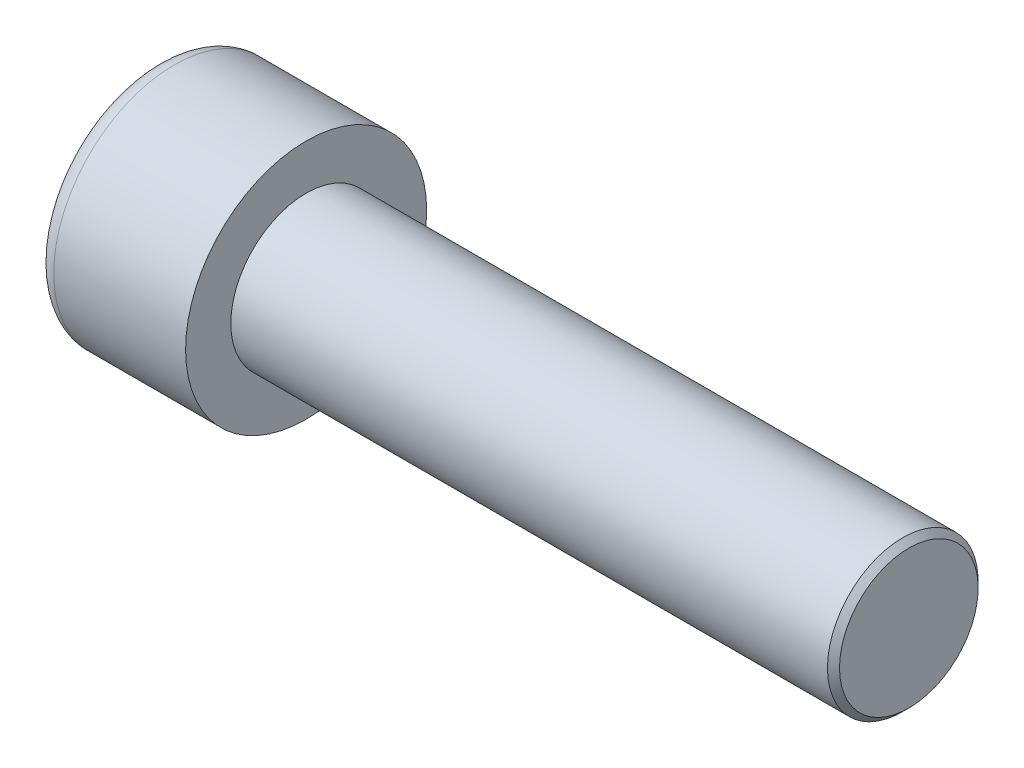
ISO-10303-21;
HEADER;
FILE_DESCRIPTION(('STEP AP214'),'2;1');
FILE_NAME('part.step','',(''),(''),'','','');
FILE_SCHEMA(('AUTOMOTIVE_DESIGN { 1 0 10303 214 1 1 1 1 }'));
ENDSEC;
DATA;
#1=APPLICATION_CONTEXT('core data for automotive mechanical design processes');
#2=APPLICATION_PROTOCOL_DEFINITION('international standard','automotive_design',2000,#1);
#3=PRODUCT_CONTEXT('',#1,'mechanical');
#4=PRODUCT('Part','Part','',(#3));
#5=PRODUCT_RELATED_PRODUCT_CATEGORY('part','',(#4));
#6=PRODUCT_DEFINITION_FORMATION('','',#4);
#7=PRODUCT_DEFINITION_CONTEXT('part definition',#1,'design');
#8=PRODUCT_DEFINITION('design','',#6,#7);
#9=PRODUCT_DEFINITION_SHAPE('','',#8);
#10=(LENGTH_UNIT() NAMED_UNIT(*) SI_UNIT(.MILLI.,.METRE.));
#11=(NAMED_UNIT(*) PLANE_ANGLE_UNIT() SI_UNIT($,.RADIAN.));
#12=(NAMED_UNIT(*) SI_UNIT($,.STERADIAN.) SOLID_ANGLE_UNIT());
#13=UNCERTAINTY_MEASURE_WITH_UNIT(LENGTH_MEASURE(1.E-05),#10,'distance_accuracy_value','');
#14=(GEOMETRIC_REPRESENTATION_CONTEXT(3) GLOBAL_UNCERTAINTY_ASSIGNED_CONTEXT((#13)) GLOBAL_UNIT_ASSIGNED_CONTEXT((#10,
#11,#12)) REPRESENTATION_CONTEXT('',''));
#15=CARTESIAN_POINT('',(0.,0.,0.));
#16=DIRECTION('',(0.,0.,1.));
#17=DIRECTION('',(1.,0.,0.));
#18=AXIS2_PLACEMENT_3D('',#15,#16,#17);
#19=CARTESIAN_POINT('',(5.0000000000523,0.,0.));
#20=DIRECTION('',(-1.,0.,0.));
#21=DIRECTION('',(0.,0.,1.));
#22=AXIS2_PLACEMENT_3D('',#19,#20,#21);
#23=CONICAL_SURFACE('',#22,3.99999999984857,1.0471975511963);
#24=CARTESIAN_POINT('',(7.30940107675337,0.,1.4210854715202E-10));
#25=VERTEX_POINT('',#24);
#26=VERTEX_LOOP('',#25);
#27=FACE_BOUND('',#26,.T.);
#28=CARTESIAN_POINT('',(5.00000000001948,0.,0.));
#29=DIRECTION('',(-1.,0.,0.));
#30=DIRECTION('',(0.,0.,1.));
#31=AXIS2_PLACEMENT_3D('',#28,#29,#30);
#32=CIRCLE('',#31,3.99999999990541);
#33=CARTESIAN_POINT('',(5.00000000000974,-1.99999999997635,3.4641016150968));
#34=VERTEX_POINT('',#33);
#35=CARTESIAN_POINT('',(5.00000000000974,1.99999999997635,3.4641016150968));
#36=VERTEX_POINT('',#35);
#37=EDGE_CURVE('E88',#34,#36,#32,.T.);
#38=ORIENTED_EDGE('',*,*,#37,.T.);
#39=CARTESIAN_POINT('',(5.00000000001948,0.,0.));
#40=DIRECTION('',(-1.,0.,0.));
#41=DIRECTION('',(0.,0.,1.));
#42=AXIS2_PLACEMENT_3D('',#39,#40,#41);
#43=CIRCLE('',#42,3.99999999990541);
#44=CARTESIAN_POINT('',(5.00000000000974,3.99999999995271,0.));
#45=VERTEX_POINT('',#44);
#46=EDGE_CURVE('E103',#36,#45,#43,.T.);
#47=ORIENTED_EDGE('',*,*,#46,.T.);
#48=CARTESIAN_POINT('',(5.00000000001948,0.,0.));
#49=DIRECTION('',(-1.,0.,0.));
#50=DIRECTION('',(0.,0.,1.));
#51=AXIS2_PLACEMENT_3D('',#48,#49,#50);
#52=CIRCLE('',#51,3.99999999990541);
#53=CARTESIAN_POINT('',(5.00000000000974,1.99999999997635,-3.4641016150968));
#54=VERTEX_POINT('',#53);
#55=EDGE_CURVE('E147',#45,#54,#52,.T.);
#56=ORIENTED_EDGE('',*,*,#55,.T.);
#57=CARTESIAN_POINT('',(5.00000000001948,0.,0.));
#58=DIRECTION('',(-1.,0.,0.));
#59=DIRECTION('',(0.,0.,1.));
#60=AXIS2_PLACEMENT_3D('',#57,#58,#59);
#61=CIRCLE('',#60,3.99999999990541);
#62=CARTESIAN_POINT('',(5.00000000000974,-1.99999999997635,-3.4641016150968));
#63=VERTEX_POINT('',#62);
#64=EDGE_CURVE('E135',#54,#63,#61,.T.);
#65=ORIENTED_EDGE('',*,*,#64,.T.);
#66=CARTESIAN_POINT('',(5.00000000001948,0.,0.));
#67=DIRECTION('',(-1.,0.,0.));
#68=DIRECTION('',(0.,0.,1.));
#69=AXIS2_PLACEMENT_3D('',#66,#67,#68);
#70=CIRCLE('',#69,3.99999999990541);
#71=CARTESIAN_POINT('',(5.00000000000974,-3.99999999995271,0.));
#72=VERTEX_POINT('',#71);
#73=EDGE_CURVE('E84',#63,#72,#70,.T.);
#74=ORIENTED_EDGE('',*,*,#73,.T.);
#75=CARTESIAN_POINT('',(5.00000000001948,0.,0.));
#76=DIRECTION('',(-1.,0.,0.));
#77=DIRECTION('',(0.,0.,1.));
#78=AXIS2_PLACEMENT_3D('',#75,#76,#77);
#79=CIRCLE('',#78,3.99999999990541);
#80=EDGE_CURVE('E86',#72,#34,#79,.T.);
#81=ORIENTED_EDGE('',*,*,#80,.T.);
#82=EDGE_LOOP('',(#38,#47,#56,#65,#74,#81));
#83=FACE_BOUND('',#82,.T.);
#84=ADVANCED_FACE('F17',(#27,#83),#23,.F.);
#85=CARTESIAN_POINT('',(5.,0.,-4.61880215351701));
#86=DIRECTION('',(1.,0.,0.));
#87=DIRECTION('',(0.,0.,-1.));
#88=AXIS2_PLACEMENT_3D('',#85,#86,#87);
#89=PLANE('',#88);
#90=DIRECTION('',(0.,0.,1.));
#91=VECTOR('',#90,1.);
#92=CARTESIAN_POINT('',(5.,-4.,2.3094010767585));
#93=LINE('',#92,#91);
#94=CARTESIAN_POINT('',(5.,-4.,2.3094010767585));
#95=VERTEX_POINT('',#94);
#96=EDGE_CURVE('E109',#95,#72,#93,.F.);
#97=ORIENTED_EDGE('',*,*,#96,.F.);
#98=DIRECTION('',(0.,0.866025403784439,0.5));
#99=VECTOR('',#98,1.);
#100=CARTESIAN_POINT('',(5.,0.,4.61880215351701));
#101=LINE('',#100,#99);
#102=EDGE_CURVE('E106',#34,#95,#101,.F.);
#103=ORIENTED_EDGE('',*,*,#102,.F.);
#104=ORIENTED_EDGE('',*,*,#80,.F.);
#105=EDGE_LOOP('',(#97,#103,#104));
#106=FACE_BOUND('',#105,.T.);
#107=ADVANCED_FACE('F107',(#106),#89,.F.);
#108=CARTESIAN_POINT('',(5.,0.,-4.61880215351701));
#109=DIRECTION('',(1.,0.,0.));
#110=DIRECTION('',(0.,0.,-1.));
#111=AXIS2_PLACEMENT_3D('',#108,#109,#110);
#112=PLANE('',#111);
#113=DIRECTION('',(0.,0.866025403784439,0.5));
#114=VECTOR('',#113,1.);
#115=CARTESIAN_POINT('',(5.,0.,4.61880215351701));
#116=LINE('',#115,#114);
#117=CARTESIAN_POINT('',(5.,0.,4.61880215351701));
#118=VERTEX_POINT('',#117);
#119=EDGE_CURVE('E98',#118,#34,#116,.F.);
#120=ORIENTED_EDGE('',*,*,#119,.F.);
#121=DIRECTION('',(0.,0.866025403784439,-0.5));
#122=VECTOR('',#121,1.);
#123=CARTESIAN_POINT('',(5.,4.,2.3094010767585));
#124=LINE('',#123,#122);
#125=EDGE_CURVE('E101',#36,#118,#124,.F.);
#126=ORIENTED_EDGE('',*,*,#125,.F.);
#127=ORIENTED_EDGE('',*,*,#37,.F.);
#128=EDGE_LOOP('',(#120,#126,#127));
#129=FACE_BOUND('',#128,.T.);
#130=ADVANCED_FACE('F96',(#129),#112,.F.);
#131=CARTESIAN_POINT('',(5.,0.,-4.61880215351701));
#132=DIRECTION('',(1.,0.,0.));
#133=DIRECTION('',(0.,0.,-1.));
#134=AXIS2_PLACEMENT_3D('',#131,#132,#133);
#135=PLANE('',#134);
#136=DIRECTION('',(0.,0.866025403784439,-0.5));
#137=VECTOR('',#136,1.);
#138=CARTESIAN_POINT('',(5.,4.,2.3094010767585));
#139=LINE('',#138,#137);
#140=CARTESIAN_POINT('',(5.,4.,2.3094010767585));
#141=VERTEX_POINT('',#140);
#142=EDGE_CURVE('E131',#141,#36,#139,.F.);
#143=ORIENTED_EDGE('',*,*,#142,.F.);
#144=DIRECTION('',(0.,0.,-1.));
#145=VECTOR('',#144,1.);
#146=CARTESIAN_POINT('',(5.,4.,-2.3094010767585));
#147=LINE('',#146,#145);
#148=EDGE_CURVE('E192',#45,#141,#147,.F.);
#149=ORIENTED_EDGE('',*,*,#148,.F.);
#150=ORIENTED_EDGE('',*,*,#46,.F.);
#151=EDGE_LOOP('',(#143,#149,#150));
#152=FACE_BOUND('',#151,.T.);
#153=ADVANCED_FACE('F401',(#152),#135,.F.);
#154=CARTESIAN_POINT('',(5.,0.,-4.61880215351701));
#155=DIRECTION('',(1.,0.,0.));
#156=DIRECTION('',(0.,0.,-1.));
#157=AXIS2_PLACEMENT_3D('',#154,#155,#156);
#158=PLANE('',#157);
#159=DIRECTION('',(0.,0.,-1.));
#160=VECTOR('',#159,1.);
#161=CARTESIAN_POINT('',(5.,4.,-2.3094010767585));
#162=LINE('',#161,#160);
#163=CARTESIAN_POINT('',(5.,4.,-2.3094010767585));
#164=VERTEX_POINT('',#163);
#165=EDGE_CURVE('E189',#164,#45,#162,.F.);
#166=ORIENTED_EDGE('',*,*,#165,.F.);
#167=DIRECTION('',(0.,-0.866025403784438,-0.5));
#168=VECTOR('',#167,1.);
#169=CARTESIAN_POINT('',(5.,0.,-4.61880215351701));
#170=LINE('',#169,#168);
#171=EDGE_CURVE('E177',#54,#164,#170,.F.);
#172=ORIENTED_EDGE('',*,*,#171,.F.);
#173=ORIENTED_EDGE('',*,*,#55,.F.);
#174=EDGE_LOOP('',(#166,#172,#173));
#175=FACE_BOUND('',#174,.T.);
#176=ADVANCED_FACE('F391',(#175),#158,.F.);
#177=CARTESIAN_POINT('',(5.,0.,-4.61880215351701));
#178=DIRECTION('',(1.,0.,0.));
#179=DIRECTION('',(0.,0.,-1.));
#180=AXIS2_PLACEMENT_3D('',#177,#178,#179);
#181=PLANE('',#180);
#182=DIRECTION('',(0.,-0.866025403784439,0.5));
#183=VECTOR('',#182,1.);
#184=CARTESIAN_POINT('',(5.,-4.,-2.3094010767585));
#185=LINE('',#184,#183);
#186=CARTESIAN_POINT('',(5.,-4.,-2.3094010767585));
#187=VERTEX_POINT('',#186);
#188=EDGE_CURVE('E231',#187,#63,#185,.F.);
#189=ORIENTED_EDGE('',*,*,#188,.F.);
#190=DIRECTION('',(0.,0.,1.));
#191=VECTOR('',#190,1.);
#192=CARTESIAN_POINT('',(5.,-4.,2.3094010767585));
#193=LINE('',#192,#191);
#194=EDGE_CURVE('E119',#72,#187,#193,.F.);
#195=ORIENTED_EDGE('',*,*,#194,.F.);
#196=ORIENTED_EDGE('',*,*,#73,.F.);
#197=EDGE_LOOP('',(#189,#195,#196));
#198=FACE_BOUND('',#197,.T.);
#199=ADVANCED_FACE('F381',(#198),#181,.F.);
#200=CARTESIAN_POINT('',(5.,0.,-4.61880215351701));
#201=DIRECTION('',(1.,0.,0.));
#202=DIRECTION('',(0.,0.,-1.));
#203=AXIS2_PLACEMENT_3D('',#200,#201,#202);
#204=PLANE('',#203);
#205=DIRECTION('',(0.,-0.866025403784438,-0.5));
#206=VECTOR('',#205,1.);
#207=CARTESIAN_POINT('',(5.,0.,-4.61880215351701));
#208=LINE('',#207,#206);
#209=CARTESIAN_POINT('',(5.,0.,-4.61880215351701));
#210=VERTEX_POINT('',#209);
#211=EDGE_CURVE('E181',#210,#54,#208,.F.);
#212=ORIENTED_EDGE('',*,*,#211,.F.);
#213=DIRECTION('',(0.,-0.866025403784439,0.5));
#214=VECTOR('',#213,1.);
#215=CARTESIAN_POINT('',(5.,-4.,-2.3094010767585));
#216=LINE('',#215,#214);
#217=EDGE_CURVE('E449',#63,#210,#216,.F.);
#218=ORIENTED_EDGE('',*,*,#217,.F.);
#219=ORIENTED_EDGE('',*,*,#64,.F.);
#220=EDGE_LOOP('',(#212,#218,#219));
#221=FACE_BOUND('',#220,.T.);
#222=ADVANCED_FACE('F371',(#221),#204,.F.);
#223=CARTESIAN_POINT('',(5.,-4.,2.3094010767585));
#224=DIRECTION('',(0.,1.,0.));
#225=DIRECTION('',(0.,0.,1.));
#226=AXIS2_PLACEMENT_3D('',#223,#224,#225);
#227=PLANE('',#226);
#228=ORIENTED_EDGE('',*,*,#194,.T.);
#229=DIRECTION('',(1.,0.,0.));
#230=VECTOR('',#229,1.);
#231=CARTESIAN_POINT('',(5.,-4.,-2.3094010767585));
#232=LINE('',#231,#230);
#233=CARTESIAN_POINT('',(0.,-4.,-2.3094010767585));
#234=VERTEX_POINT('',#233);
#235=EDGE_CURVE('E186',#234,#187,#232,.T.);
#236=ORIENTED_EDGE('',*,*,#235,.F.);
#237=DIRECTION('',(0.,0.,-1.));
#238=VECTOR('',#237,1.);
#239=CARTESIAN_POINT('',(0.,-4.,0.));
#240=LINE('',#239,#238);
#241=CARTESIAN_POINT('',(0.,-4.,2.3094010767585));
#242=VERTEX_POINT('',#241);
#243=EDGE_CURVE('E170',#234,#242,#240,.F.);
#244=ORIENTED_EDGE('',*,*,#243,.T.);
#245=DIRECTION('',(1.,0.,0.));
#246=VECTOR('',#245,1.);
#247=CARTESIAN_POINT('',(5.,-4.,2.3094010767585));
#248=LINE('',#247,#246);
#249=EDGE_CURVE('E113',#95,#242,#248,.F.);
#250=ORIENTED_EDGE('',*,*,#249,.F.);
#251=ORIENTED_EDGE('',*,*,#96,.T.);
#252=EDGE_LOOP('',(#228,#236,#244,#250,#251));
#253=FACE_BOUND('',#252,.T.);
#254=ADVANCED_FACE('F362',(#253),#227,.T.);
#255=CARTESIAN_POINT('',(5.,0.,4.61880215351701));
#256=DIRECTION('',(0.,0.5,-0.866025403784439));
#257=DIRECTION('',(0.,0.866025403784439,0.5));
#258=AXIS2_PLACEMENT_3D('',#255,#256,#257);
#259=PLANE('',#258);
#260=ORIENTED_EDGE('',*,*,#102,.T.);
#261=ORIENTED_EDGE('',*,*,#249,.T.);
#262=DIRECTION('',(0.,0.866025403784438,0.5));
#263=VECTOR('',#262,1.);
#264=CARTESIAN_POINT('',(0.,-4.,2.3094010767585));
#265=LINE('',#264,#263);
#266=CARTESIAN_POINT('',(0.,0.,4.61880215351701));
#267=VERTEX_POINT('',#266);
#268=EDGE_CURVE('E173',#242,#267,#265,.T.);
#269=ORIENTED_EDGE('',*,*,#268,.T.);
#270=DIRECTION('',(1.,0.,0.));
#271=VECTOR('',#270,1.);
#272=CARTESIAN_POINT('',(5.,0.,4.61880215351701));
#273=LINE('',#272,#271);
#274=EDGE_CURVE('E118',#118,#267,#273,.F.);
#275=ORIENTED_EDGE('',*,*,#274,.F.);
#276=ORIENTED_EDGE('',*,*,#119,.T.);
#277=EDGE_LOOP('',(#260,#261,#269,#275,#276));
#278=FACE_BOUND('',#277,.T.);
#279=ADVANCED_FACE('F115',(#278),#259,.T.);
#280=CARTESIAN_POINT('',(5.,4.,2.3094010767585));
#281=DIRECTION('',(0.,-0.5,-0.866025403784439));
#282=DIRECTION('',(0.,0.866025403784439,-0.5));
#283=AXIS2_PLACEMENT_3D('',#280,#281,#282);
#284=PLANE('',#283);
#285=ORIENTED_EDGE('',*,*,#125,.T.);
#286=ORIENTED_EDGE('',*,*,#274,.T.);
#287=DIRECTION('',(0.,0.866025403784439,-0.5));
#288=VECTOR('',#287,1.);
#289=CARTESIAN_POINT('',(0.,0.,4.61880215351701));
#290=LINE('',#289,#288);
#291=CARTESIAN_POINT('',(0.,4.,2.3094010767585));
#292=VERTEX_POINT('',#291);
#293=EDGE_CURVE('E216',#267,#292,#290,.T.);
#294=ORIENTED_EDGE('',*,*,#293,.T.);
#295=DIRECTION('',(1.,0.,0.));
#296=VECTOR('',#295,1.);
#297=CARTESIAN_POINT('',(5.,4.,2.3094010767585));
#298=LINE('',#297,#296);
#299=EDGE_CURVE('E197',#141,#292,#298,.F.);
#300=ORIENTED_EDGE('',*,*,#299,.F.);
#301=ORIENTED_EDGE('',*,*,#142,.T.);
#302=EDGE_LOOP('',(#285,#286,#294,#300,#301));
#303=FACE_BOUND('',#302,.T.);
#304=ADVANCED_FACE('F213',(#303),#284,.T.);
#305=CARTESIAN_POINT('',(5.,4.,-2.3094010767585));
#306=DIRECTION('',(0.,-1.,0.));
#307=DIRECTION('',(0.,0.,-1.));
#308=AXIS2_PLACEMENT_3D('',#305,#306,#307);
#309=PLANE('',#308);
#310=ORIENTED_EDGE('',*,*,#148,.T.);
#311=ORIENTED_EDGE('',*,*,#299,.T.);
#312=DIRECTION('',(0.,0.,-1.));
#313=VECTOR('',#312,1.);
#314=CARTESIAN_POINT('',(0.,4.,0.));
#315=LINE('',#314,#313);
#316=CARTESIAN_POINT('',(0.,4.,-2.3094010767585));
#317=VERTEX_POINT('',#316);
#318=EDGE_CURVE('E163',#292,#317,#315,.T.);
#319=ORIENTED_EDGE('',*,*,#318,.T.);
#320=DIRECTION('',(1.,0.,0.));
#321=VECTOR('',#320,1.);
#322=CARTESIAN_POINT('',(5.,4.,-2.3094010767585));
#323=LINE('',#322,#321);
#324=EDGE_CURVE('E180',#164,#317,#323,.F.);
#325=ORIENTED_EDGE('',*,*,#324,.F.);
#326=ORIENTED_EDGE('',*,*,#165,.T.);
#327=EDGE_LOOP('',(#310,#311,#319,#325,#326));
#328=FACE_BOUND('',#327,.T.);
#329=ADVANCED_FACE('F335',(#328),#309,.T.);
#330=CARTESIAN_POINT('',(5.,0.,-4.61880215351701));
#331=DIRECTION('',(0.,-0.5,0.866025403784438));
#332=DIRECTION('',(0.,-0.866025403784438,-0.5));
#333=AXIS2_PLACEMENT_3D('',#330,#331,#332);
#334=PLANE('',#333);
#335=ORIENTED_EDGE('',*,*,#171,.T.);
#336=ORIENTED_EDGE('',*,*,#324,.T.);
#337=DIRECTION('',(0.,-0.866025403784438,-0.5));
#338=VECTOR('',#337,1.);
#339=CARTESIAN_POINT('',(0.,4.,-2.3094010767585));
#340=LINE('',#339,#338);
#341=CARTESIAN_POINT('',(0.,0.,-4.61880215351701));
#342=VERTEX_POINT('',#341);
#343=EDGE_CURVE('E155',#317,#342,#340,.T.);
#344=ORIENTED_EDGE('',*,*,#343,.T.);
#345=DIRECTION('',(1.,0.,0.));
#346=VECTOR('',#345,1.);
#347=CARTESIAN_POINT('',(5.,0.,-4.61880215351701));
#348=LINE('',#347,#346);
#349=EDGE_CURVE('E174',#210,#342,#348,.F.);
#350=ORIENTED_EDGE('',*,*,#349,.F.);
#351=ORIENTED_EDGE('',*,*,#211,.T.);
#352=EDGE_LOOP('',(#335,#336,#344,#350,#351));
#353=FACE_BOUND('',#352,.T.);
#354=ADVANCED_FACE('F275',(#353),#334,.T.);
#355=CARTESIAN_POINT('',(5.,-4.,-2.3094010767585));
#356=DIRECTION('',(0.,0.5,0.866025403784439));
#357=DIRECTION('',(0.,-0.866025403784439,0.5));
#358=AXIS2_PLACEMENT_3D('',#355,#356,#357);
#359=PLANE('',#358);
#360=ORIENTED_EDGE('',*,*,#217,.T.);
#361=ORIENTED_EDGE('',*,*,#349,.T.);
#362=DIRECTION('',(0.,-0.866025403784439,0.5));
#363=VECTOR('',#362,1.);
#364=CARTESIAN_POINT('',(0.,0.,-4.61880215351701));
#365=LINE('',#364,#363);
#366=EDGE_CURVE('E153',#342,#234,#365,.T.);
#367=ORIENTED_EDGE('',*,*,#366,.T.);
#368=ORIENTED_EDGE('',*,*,#235,.T.);
#369=ORIENTED_EDGE('',*,*,#188,.T.);
#370=EDGE_LOOP('',(#360,#361,#367,#368,#369));
#371=FACE_BOUND('',#370,.T.);
#372=ADVANCED_FACE('F270',(#371),#359,.T.);
#373=CARTESIAN_POINT('',(0.,0.,0.));
#374=DIRECTION('',(1.,0.,0.));
#375=DIRECTION('',(0.,0.,-1.));
#376=AXIS2_PLACEMENT_3D('',#373,#374,#375);
#377=PLANE('',#376);
#378=ORIENTED_EDGE('',*,*,#343,.F.);
#379=ORIENTED_EDGE('',*,*,#318,.F.);
#380=ORIENTED_EDGE('',*,*,#293,.F.);
#381=ORIENTED_EDGE('',*,*,#268,.F.);
#382=ORIENTED_EDGE('',*,*,#243,.F.);
#383=ORIENTED_EDGE('',*,*,#366,.F.);
#384=EDGE_LOOP('',(#378,#379,#380,#381,#382,#383));
#385=FACE_BOUND('',#384,.T.);
#386=CARTESIAN_POINT('',(0.,0.,0.));
#387=DIRECTION('',(1.,0.,0.));
#388=DIRECTION('',(0.,0.,-1.));
#389=AXIS2_PLACEMENT_3D('',#386,#387,#388);
#390=CIRCLE('',#389,6.75);
#391=CARTESIAN_POINT('',(0.,0.,-6.75));
#392=VERTEX_POINT('',#391);
#393=CARTESIAN_POINT('',(0.,0.,6.75));
#394=VERTEX_POINT('',#393);
#395=EDGE_CURVE('E151',#392,#394,#390,.T.);
#396=ORIENTED_EDGE('',*,*,#395,.F.);
#397=CARTESIAN_POINT('',(0.,0.,0.));
#398=DIRECTION('',(1.,0.,0.));
#399=DIRECTION('',(0.,0.,1.));
#400=AXIS2_PLACEMENT_3D('',#397,#398,#399);
#401=CIRCLE('',#400,6.75);
#402=EDGE_CURVE('E36',#394,#392,#401,.T.);
#403=ORIENTED_EDGE('',*,*,#402,.F.);
#404=EDGE_LOOP('',(#396,#403));
#405=FACE_BOUND('',#404,.T.);
#406=ADVANCED_FACE('F222',(#385,#405),#377,.F.);
#407=CARTESIAN_POINT('',(1.25,0.,0.));
#408=DIRECTION('',(1.,0.,0.));
#409=DIRECTION('',(0.,0.,-1.));
#410=AXIS2_PLACEMENT_3D('',#407,#408,#409);
#411=TOROIDAL_SURFACE('',#410,6.75,1.25);
#412=CARTESIAN_POINT('',(1.25,0.,0.));
#413=DIRECTION('',(-1.,0.,0.));
#414=DIRECTION('',(0.,0.,1.));
#415=AXIS2_PLACEMENT_3D('',#412,#413,#414);
#416=CIRCLE('',#415,8.);
#417=CARTESIAN_POINT('',(1.25,0.,8.));
#418=VERTEX_POINT('',#417);
#419=EDGE_CURVE('E144',#418,#418,#416,.F.);
#420=ORIENTED_EDGE('',*,*,#419,.F.);
#421=EDGE_LOOP('',(#420));
#422=FACE_BOUND('',#421,.T.);
#423=ORIENTED_EDGE('',*,*,#395,.T.);
#424=ORIENTED_EDGE('',*,*,#402,.T.);
#425=EDGE_LOOP('',(#423,#424));
#426=FACE_BOUND('',#425,.T.);
#427=ADVANCED_FACE('F150',(#422,#426),#411,.T.);
#428=CARTESIAN_POINT('',(50.,0.,0.));
#429=DIRECTION('',(1.,0.,0.));
#430=DIRECTION('',(0.,0.,-1.));
#431=AXIS2_PLACEMENT_3D('',#428,#429,#430);
#432=PLANE('',#431);
#433=CARTESIAN_POINT('',(49.9999999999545,0.,0.));
#434=DIRECTION('',(-1.,0.,0.));
#435=DIRECTION('',(0.,0.,1.));
#436=AXIS2_PLACEMENT_3D('',#433,#434,#435);
#437=CIRCLE('',#436,4.59999999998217);
#438=CARTESIAN_POINT('',(49.9999999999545,0.,4.59999999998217));
#439=VERTEX_POINT('',#438);
#440=EDGE_CURVE('E141',#439,#439,#437,.T.);
#441=ORIENTED_EDGE('',*,*,#440,.F.);
#442=EDGE_LOOP('',(#441));
#443=FACE_BOUND('',#442,.T.);
#444=ADVANCED_FACE('F243',(#443),#432,.T.);
#445=CARTESIAN_POINT('',(10.,0.,0.));
#446=DIRECTION('',(-1.,0.,0.));
#447=DIRECTION('',(0.,0.,1.));
#448=AXIS2_PLACEMENT_3D('',#445,#446,#447);
#449=CYLINDRICAL_SURFACE('',#448,8.);
#450=ORIENTED_EDGE('',*,*,#419,.T.);
#451=EDGE_LOOP('',(#450));
#452=FACE_BOUND('',#451,.T.);
#453=CARTESIAN_POINT('',(10.,0.,0.));
#454=DIRECTION('',(-1.,0.,0.));
#455=DIRECTION('',(0.,0.,1.));
#456=AXIS2_PLACEMENT_3D('',#453,#454,#455);
#457=CIRCLE('',#456,8.);
#458=CARTESIAN_POINT('',(10.,0.,8.));
#459=VERTEX_POINT('',#458);
#460=EDGE_CURVE('E138',#459,#459,#457,.F.);
#461=ORIENTED_EDGE('',*,*,#460,.F.);
#462=EDGE_LOOP('',(#461));
#463=FACE_BOUND('',#462,.T.);
#464=ADVANCED_FACE('F290',(#452,#463),#449,.T.);
#465=CARTESIAN_POINT('',(49.5999999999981,0.,0.));
#466=DIRECTION('',(-1.,0.,0.));
#467=DIRECTION('',(0.,0.,1.));
#468=AXIS2_PLACEMENT_3D('',#465,#466,#467);
#469=CONICAL_SURFACE('',#468,4.99999999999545,0.785398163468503);
#470=CARTESIAN_POINT('',(49.6,0.,0.));
#471=DIRECTION('',(-1.,0.,0.));
#472=DIRECTION('',(0.,0.,1.));
#473=AXIS2_PLACEMENT_3D('',#470,#471,#472);
#474=CIRCLE('',#473,5.);
#475=CARTESIAN_POINT('',(49.6,0.,5.));
#476=VERTEX_POINT('',#475);
#477=EDGE_CURVE('E28',#476,#476,#474,.T.);
#478=ORIENTED_EDGE('',*,*,#477,.F.);
#479=EDGE_LOOP('',(#478));
#480=FACE_BOUND('',#479,.T.);
#481=ORIENTED_EDGE('',*,*,#440,.T.);
#482=EDGE_LOOP('',(#481));
#483=FACE_BOUND('',#482,.T.);
#484=ADVANCED_FACE('F284',(#480,#483),#469,.T.);
#485=CARTESIAN_POINT('',(10.,0.,0.));
#486=DIRECTION('',(1.,0.,0.));
#487=DIRECTION('',(0.,0.,-1.));
#488=AXIS2_PLACEMENT_3D('',#485,#486,#487);
#489=PLANE('',#488);
#490=CARTESIAN_POINT('',(10.,0.,0.));
#491=DIRECTION('',(-1.,0.,0.));
#492=DIRECTION('',(0.,0.,1.));
#493=AXIS2_PLACEMENT_3D('',#490,#491,#492);
#494=CIRCLE('',#493,5.);
#495=CARTESIAN_POINT('',(10.,0.,5.));
#496=VERTEX_POINT('',#495);
#497=EDGE_CURVE('E11',#496,#496,#494,.F.);
#498=ORIENTED_EDGE('',*,*,#497,.F.);
#499=EDGE_LOOP('',(#498));
#500=FACE_BOUND('',#499,.T.);
#501=ORIENTED_EDGE('',*,*,#460,.T.);
#502=EDGE_LOOP('',(#501));
#503=FACE_BOUND('',#502,.T.);
#504=ADVANCED_FACE('F278',(#500,#503),#489,.T.);
#505=CARTESIAN_POINT('',(50.,0.,0.));
#506=DIRECTION('',(-1.,0.,0.));
#507=DIRECTION('',(0.,0.,1.));
#508=AXIS2_PLACEMENT_3D('',#505,#506,#507);
#509=CYLINDRICAL_SURFACE('',#508,5.);
#510=ORIENTED_EDGE('',*,*,#497,.T.);
#511=EDGE_LOOP('',(#510));
#512=FACE_BOUND('',#511,.T.);
#513=ORIENTED_EDGE('',*,*,#477,.T.);
#514=EDGE_LOOP('',(#513));
#515=FACE_BOUND('',#514,.T.);
#516=ADVANCED_FACE('F276',(#512,#515),#509,.T.);
#517=CLOSED_SHELL('',(#84,#107,#130,#153,#176,#199,#222,#254,#279,#304,#329,#354,#372,#406,#427,
#444,#464,#484,#504,#516));
#518=MANIFOLD_SOLID_BREP('B1',#517);
#519=ADVANCED_BREP_SHAPE_REPRESENTATION('',(#18,#518),#14);
#520=SHAPE_DEFINITION_REPRESENTATION(#9,#519);
ENDSEC;
END-ISO-10303-21;
